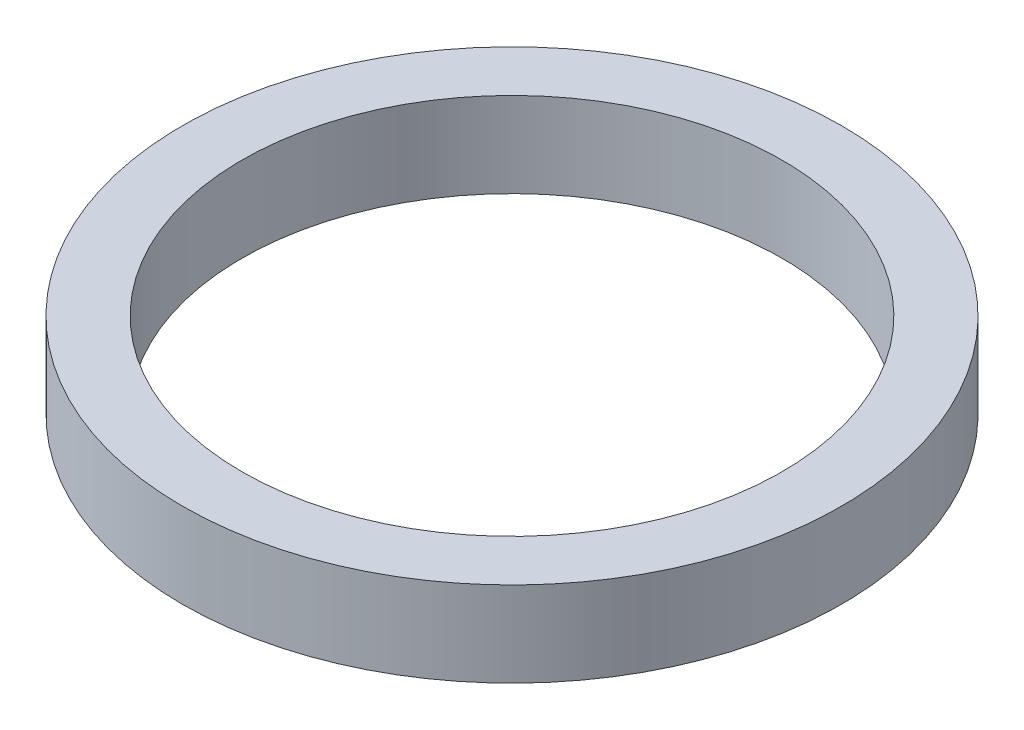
from build123d import *

# Parameters (mm, degrees)
SKETCH1_R           = 19.375
SKETCH1_R_2         = 15.875
BOSS_EXTRUDE1_DEPTH = 5


with BuildPart() as part:
    # Sketch1 → Boss-Extrude1 (new body)
    with BuildSketch(Plane(origin=(0, 0, 0), x_dir=(1, 0, 0), z_dir=(0, 1, 0))):
        with Locations(Location((0, 0, 0), (0, 0, 270))):
            Circle(SKETCH1_R)
        with Locations(Location((0, 0, 0), (0, 0, 270))):
            Circle(SKETCH1_R_2, mode=Mode.SUBTRACT)
    extrude(amount=BOSS_EXTRUDE1_DEPTH)


solid = part.part
